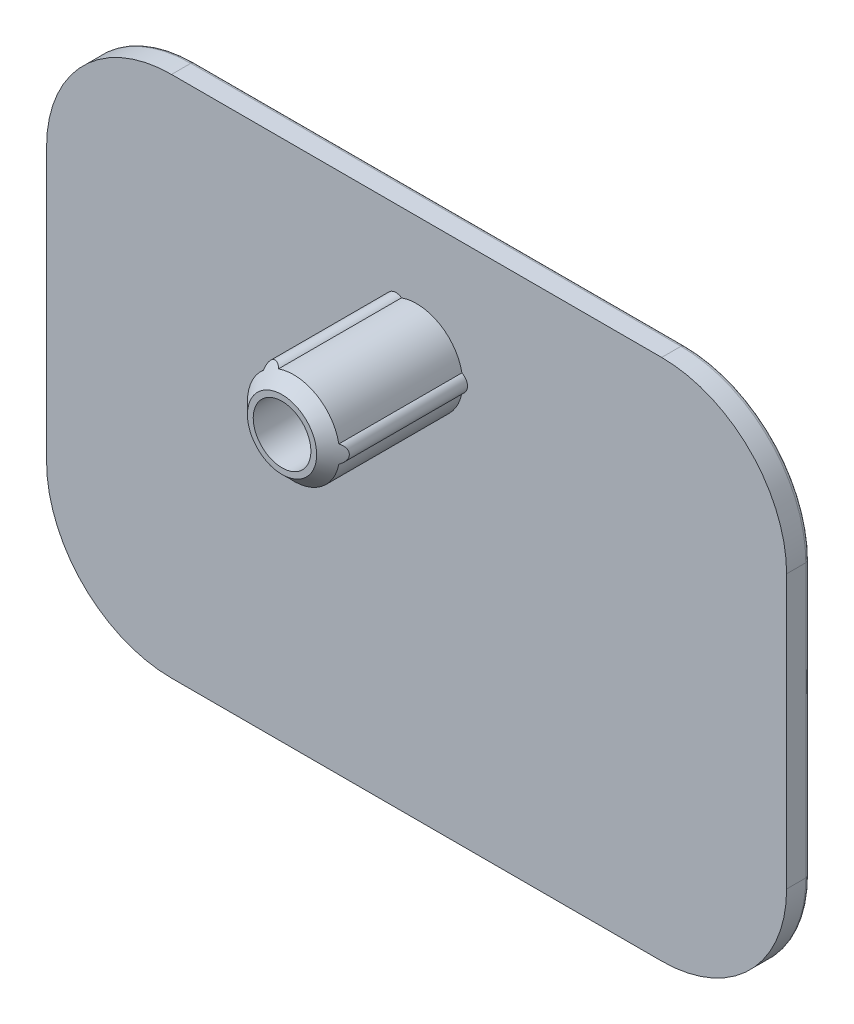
ISO-10303-21;
HEADER;
FILE_DESCRIPTION(('STEP AP214'),'2;1');
FILE_NAME('part.step','',(''),(''),'','','');
FILE_SCHEMA(('AUTOMOTIVE_DESIGN { 1 0 10303 214 1 1 1 1 }'));
ENDSEC;
DATA;
#1=APPLICATION_CONTEXT('core data for automotive mechanical design processes');
#2=APPLICATION_PROTOCOL_DEFINITION('international standard','automotive_design',2000,#1);
#3=PRODUCT_CONTEXT('',#1,'mechanical');
#4=PRODUCT('Part','Part','',(#3));
#5=PRODUCT_RELATED_PRODUCT_CATEGORY('part','',(#4));
#6=PRODUCT_DEFINITION_FORMATION('','',#4);
#7=PRODUCT_DEFINITION_CONTEXT('part definition',#1,'design');
#8=PRODUCT_DEFINITION('design','',#6,#7);
#9=PRODUCT_DEFINITION_SHAPE('','',#8);
#10=(LENGTH_UNIT() NAMED_UNIT(*) SI_UNIT(.MILLI.,.METRE.));
#11=(NAMED_UNIT(*) PLANE_ANGLE_UNIT() SI_UNIT($,.RADIAN.));
#12=(NAMED_UNIT(*) SI_UNIT($,.STERADIAN.) SOLID_ANGLE_UNIT());
#13=UNCERTAINTY_MEASURE_WITH_UNIT(LENGTH_MEASURE(1.E-05),#10,'distance_accuracy_value','');
#14=(GEOMETRIC_REPRESENTATION_CONTEXT(3) GLOBAL_UNCERTAINTY_ASSIGNED_CONTEXT((#13)) GLOBAL_UNIT_ASSIGNED_CONTEXT((#10,
#11,#12)) REPRESENTATION_CONTEXT('',''));
#15=CARTESIAN_POINT('',(0.,0.,0.));
#16=DIRECTION('',(0.,0.,1.));
#17=DIRECTION('',(1.,0.,0.));
#18=AXIS2_PLACEMENT_3D('',#15,#16,#17);
#19=CARTESIAN_POINT('',(0.,7.25,1.1));
#20=DIRECTION('',(0.,0.,-1.));
#21=DIRECTION('',(-1.,0.,0.));
#22=AXIS2_PLACEMENT_3D('',#19,#20,#21);
#23=PLANE('',#22);
#24=CARTESIAN_POINT('',(0.,7.25,1.1));
#25=DIRECTION('',(0.,0.,-1.));
#26=DIRECTION('',(-1.,0.,0.));
#27=AXIS2_PLACEMENT_3D('',#24,#25,#26);
#28=CIRCLE('',#27,1.5);
#29=CARTESIAN_POINT('',(-1.5,7.25,1.1));
#30=VERTEX_POINT('',#29);
#31=EDGE_CURVE('E19',#30,#30,#28,.F.);
#32=ORIENTED_EDGE('',*,*,#31,.T.);
#33=EDGE_LOOP('',(#32));
#34=FACE_BOUND('',#33,.T.);
#35=ADVANCED_FACE('F16',(#34),#23,.F.);
#36=CARTESIAN_POINT('',(0.,7.25,7.6));
#37=DIRECTION('',(0.,0.,-1.));
#38=DIRECTION('',(-1.,0.,0.));
#39=AXIS2_PLACEMENT_3D('',#36,#37,#38);
#40=CYLINDRICAL_SURFACE('',#39,1.5);
#41=CARTESIAN_POINT('',(0.,7.25,7.6));
#42=DIRECTION('',(0.,0.,-1.));
#43=DIRECTION('',(-1.,0.,0.));
#44=AXIS2_PLACEMENT_3D('',#41,#42,#43);
#45=CIRCLE('',#44,1.5);
#46=CARTESIAN_POINT('',(-1.5,7.25,7.6));
#47=VERTEX_POINT('',#46);
#48=EDGE_CURVE('E248',#47,#47,#45,.T.);
#49=ORIENTED_EDGE('',*,*,#48,.F.);
#50=EDGE_LOOP('',(#49));
#51=FACE_BOUND('',#50,.T.);
#52=ORIENTED_EDGE('',*,*,#31,.F.);
#53=EDGE_LOOP('',(#52));
#54=FACE_BOUND('',#53,.T.);
#55=ADVANCED_FACE('F379',(#51,#54),#40,.F.);
#56=CARTESIAN_POINT('',(0.,0.,-0.6));
#57=DIRECTION('',(0.,0.,1.));
#58=DIRECTION('',(1.,0.,0.));
#59=AXIS2_PLACEMENT_3D('',#56,#57,#58);
#60=PLANE('',#59);
#61=DIRECTION('',(0.,-1.,0.));
#62=VECTOR('',#61,1.);
#63=CARTESIAN_POINT('',(-19.05,-3.55,-0.6));
#64=LINE('',#63,#62);
#65=CARTESIAN_POINT('',(-19.05,7.1,-0.6));
#66=VERTEX_POINT('',#65);
#67=CARTESIAN_POINT('',(-19.05,-7.1,-0.6));
#68=VERTEX_POINT('',#67);
#69=EDGE_CURVE('E317',#66,#68,#64,.T.);
#70=ORIENTED_EDGE('',*,*,#69,.F.);
#71=CARTESIAN_POINT('',(-12.75,7.1,-0.6));
#72=DIRECTION('',(0.,0.,1.));
#73=DIRECTION('',(0.,1.,0.));
#74=AXIS2_PLACEMENT_3D('',#71,#72,#73);
#75=CIRCLE('',#74,6.30000000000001);
#76=CARTESIAN_POINT('',(-12.75,13.4,-0.6));
#77=VERTEX_POINT('',#76);
#78=EDGE_CURVE('E335',#77,#66,#75,.T.);
#79=ORIENTED_EDGE('',*,*,#78,.F.);
#80=DIRECTION('',(-1.,0.,0.));
#81=VECTOR('',#80,1.);
#82=CARTESIAN_POINT('',(-6.375,13.4,-0.6));
#83=LINE('',#82,#81);
#84=CARTESIAN_POINT('',(12.75,13.4,-0.6));
#85=VERTEX_POINT('',#84);
#86=EDGE_CURVE('E244',#85,#77,#83,.T.);
#87=ORIENTED_EDGE('',*,*,#86,.F.);
#88=CARTESIAN_POINT('',(12.75,7.1,-0.6));
#89=DIRECTION('',(0.,0.,1.));
#90=DIRECTION('',(1.,0.,0.));
#91=AXIS2_PLACEMENT_3D('',#88,#89,#90);
#92=CIRCLE('',#91,6.3);
#93=CARTESIAN_POINT('',(19.05,7.1,-0.6));
#94=VERTEX_POINT('',#93);
#95=EDGE_CURVE('E435',#94,#85,#92,.T.);
#96=ORIENTED_EDGE('',*,*,#95,.F.);
#97=DIRECTION('',(0.,1.,0.));
#98=VECTOR('',#97,1.);
#99=CARTESIAN_POINT('',(19.05,3.55,-0.6));
#100=LINE('',#99,#98);
#101=CARTESIAN_POINT('',(19.05,-7.1,-0.6));
#102=VERTEX_POINT('',#101);
#103=EDGE_CURVE('E232',#102,#94,#100,.T.);
#104=ORIENTED_EDGE('',*,*,#103,.F.);
#105=CARTESIAN_POINT('',(12.75,-7.1,-0.6));
#106=DIRECTION('',(0.,0.,1.));
#107=DIRECTION('',(0.,-1.,0.));
#108=AXIS2_PLACEMENT_3D('',#105,#106,#107);
#109=CIRCLE('',#108,6.30000000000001);
#110=CARTESIAN_POINT('',(12.75,-13.4,-0.6));
#111=VERTEX_POINT('',#110);
#112=EDGE_CURVE('E258',#111,#102,#109,.T.);
#113=ORIENTED_EDGE('',*,*,#112,.F.);
#114=DIRECTION('',(1.,0.,0.));
#115=VECTOR('',#114,1.);
#116=CARTESIAN_POINT('',(6.375,-13.4,-0.6));
#117=LINE('',#116,#115);
#118=CARTESIAN_POINT('',(-12.75,-13.4,-0.6));
#119=VERTEX_POINT('',#118);
#120=EDGE_CURVE('E263',#119,#111,#117,.T.);
#121=ORIENTED_EDGE('',*,*,#120,.F.);
#122=CARTESIAN_POINT('',(-12.75,-7.1,-0.6));
#123=DIRECTION('',(0.,0.,1.));
#124=DIRECTION('',(-1.,0.,0.));
#125=AXIS2_PLACEMENT_3D('',#122,#123,#124);
#126=CIRCLE('',#125,6.3);
#127=EDGE_CURVE('E293',#68,#119,#126,.T.);
#128=ORIENTED_EDGE('',*,*,#127,.F.);
#129=EDGE_LOOP('',(#70,#79,#87,#96,#104,#113,#121,#128));
#130=FACE_BOUND('',#129,.T.);
#131=ADVANCED_FACE('F370',(#130),#60,.F.);
#132=CARTESIAN_POINT('',(0.,7.25,7.6));
#133=DIRECTION('',(0.,0.,1.));
#134=DIRECTION('',(1.,0.,0.));
#135=AXIS2_PLACEMENT_3D('',#132,#133,#134);
#136=PLANE('',#135);
#137=ORIENTED_EDGE('',*,*,#48,.T.);
#138=EDGE_LOOP('',(#137));
#139=FACE_BOUND('',#138,.T.);
#140=CARTESIAN_POINT('',(0.,7.25,7.60000000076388));
#141=DIRECTION('',(0.,0.,-1.));
#142=DIRECTION('',(-1.,0.,0.));
#143=AXIS2_PLACEMENT_3D('',#140,#141,#142);
#144=CIRCLE('',#143,1.80000000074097);
#145=CARTESIAN_POINT('',(-1.80000000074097,7.25,7.60000000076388));
#146=VERTEX_POINT('',#145);
#147=EDGE_CURVE('E514',#146,#146,#144,.T.);
#148=ORIENTED_EDGE('',*,*,#147,.F.);
#149=EDGE_LOOP('',(#148));
#150=FACE_BOUND('',#149,.T.);
#151=ADVANCED_FACE('F378',(#139,#150),#136,.T.);
#152=CARTESIAN_POINT('',(-6.375,13.4,-0.4));
#153=DIRECTION('',(-1.,0.,0.));
#154=DIRECTION('',(0.,0.,1.));
#155=AXIS2_PLACEMENT_3D('',#152,#153,#154);
#156=CYLINDRICAL_SURFACE('',#155,0.2);
#157=CARTESIAN_POINT('',(-12.75,13.4,-0.4));
#158=DIRECTION('',(-1.,0.,0.));
#159=DIRECTION('',(0.,1.,0.));
#160=AXIS2_PLACEMENT_3D('',#157,#158,#159);
#161=CIRCLE('',#160,0.2);
#162=CARTESIAN_POINT('',(-12.75,13.6,-0.4));
#163=VERTEX_POINT('',#162);
#164=EDGE_CURVE('E247',#163,#77,#161,.T.);
#165=ORIENTED_EDGE('',*,*,#164,.F.);
#166=DIRECTION('',(1.,0.,0.));
#167=VECTOR('',#166,1.);
#168=CARTESIAN_POINT('',(-12.75,13.6,-0.4));
#169=LINE('',#168,#167);
#170=CARTESIAN_POINT('',(12.75,13.6,-0.4));
#171=VERTEX_POINT('',#170);
#172=EDGE_CURVE('E204',#171,#163,#169,.F.);
#173=ORIENTED_EDGE('',*,*,#172,.F.);
#174=CARTESIAN_POINT('',(12.75,13.4,-0.4));
#175=DIRECTION('',(-1.,0.,0.));
#176=DIRECTION('',(0.,1.,0.));
#177=AXIS2_PLACEMENT_3D('',#174,#175,#176);
#178=CIRCLE('',#177,0.2);
#179=EDGE_CURVE('E240',#85,#171,#178,.F.);
#180=ORIENTED_EDGE('',*,*,#179,.F.);
#181=ORIENTED_EDGE('',*,*,#86,.T.);
#182=EDGE_LOOP('',(#165,#173,#180,#181));
#183=FACE_BOUND('',#182,.T.);
#184=ADVANCED_FACE('F350',(#183),#156,.T.);
#185=CARTESIAN_POINT('',(-12.75,7.1,-0.4));
#186=DIRECTION('',(0.,0.,1.));
#187=DIRECTION('',(1.,0.,0.));
#188=AXIS2_PLACEMENT_3D('',#185,#186,#187);
#189=TOROIDAL_SURFACE('',#188,6.30000000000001,0.2);
#190=CARTESIAN_POINT('',(-19.05,7.1,-0.4));
#191=DIRECTION('',(0.,-1.,0.));
#192=DIRECTION('',(0.,0.,-1.));
#193=AXIS2_PLACEMENT_3D('',#190,#191,#192);
#194=CIRCLE('',#193,0.2);
#195=CARTESIAN_POINT('',(-19.25,7.1,-0.4));
#196=VERTEX_POINT('',#195);
#197=EDGE_CURVE('E325',#196,#66,#194,.T.);
#198=ORIENTED_EDGE('',*,*,#197,.F.);
#199=CARTESIAN_POINT('',(-12.75,7.1,-0.4));
#200=DIRECTION('',(0.,0.,1.));
#201=DIRECTION('',(1.,0.,0.));
#202=AXIS2_PLACEMENT_3D('',#199,#200,#201);
#203=CIRCLE('',#202,6.50000000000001);
#204=EDGE_CURVE('E191',#163,#196,#203,.T.);
#205=ORIENTED_EDGE('',*,*,#204,.F.);
#206=ORIENTED_EDGE('',*,*,#164,.T.);
#207=ORIENTED_EDGE('',*,*,#78,.T.);
#208=EDGE_LOOP('',(#198,#205,#206,#207));
#209=FACE_BOUND('',#208,.T.);
#210=ADVANCED_FACE('F340',(#209),#189,.T.);
#211=CARTESIAN_POINT('',(-19.05,-3.55,-0.4));
#212=DIRECTION('',(0.,-1.,0.));
#213=DIRECTION('',(0.,0.,-1.));
#214=AXIS2_PLACEMENT_3D('',#211,#212,#213);
#215=CYLINDRICAL_SURFACE('',#214,0.2);
#216=CARTESIAN_POINT('',(-19.05,-7.1,-0.4));
#217=DIRECTION('',(0.,-1.,0.));
#218=DIRECTION('',(-1.,0.,0.));
#219=AXIS2_PLACEMENT_3D('',#216,#217,#218);
#220=CIRCLE('',#219,0.2);
#221=CARTESIAN_POINT('',(-19.25,-7.1,-0.4));
#222=VERTEX_POINT('',#221);
#223=EDGE_CURVE('E302',#222,#68,#220,.T.);
#224=ORIENTED_EDGE('',*,*,#223,.F.);
#225=DIRECTION('',(0.,1.,0.));
#226=VECTOR('',#225,1.);
#227=CARTESIAN_POINT('',(-19.25,-7.1,-0.4));
#228=LINE('',#227,#226);
#229=EDGE_CURVE('E185',#196,#222,#228,.F.);
#230=ORIENTED_EDGE('',*,*,#229,.F.);
#231=ORIENTED_EDGE('',*,*,#197,.T.);
#232=ORIENTED_EDGE('',*,*,#69,.T.);
#233=EDGE_LOOP('',(#224,#230,#231,#232));
#234=FACE_BOUND('',#233,.T.);
#235=ADVANCED_FACE('F308',(#234),#215,.T.);
#236=CARTESIAN_POINT('',(-12.75,-7.1,-0.4));
#237=DIRECTION('',(0.,0.,1.));
#238=DIRECTION('',(1.,0.,0.));
#239=AXIS2_PLACEMENT_3D('',#236,#237,#238);
#240=TOROIDAL_SURFACE('',#239,6.3,0.2);
#241=CARTESIAN_POINT('',(-12.75,-13.4,-0.4));
#242=DIRECTION('',(1.,0.,0.));
#243=DIRECTION('',(0.,1.,0.));
#244=AXIS2_PLACEMENT_3D('',#241,#242,#243);
#245=CIRCLE('',#244,0.2);
#246=CARTESIAN_POINT('',(-12.75,-13.6,-0.4));
#247=VERTEX_POINT('',#246);
#248=EDGE_CURVE('E290',#247,#119,#245,.T.);
#249=ORIENTED_EDGE('',*,*,#248,.F.);
#250=CARTESIAN_POINT('',(-12.75,-7.1,-0.4));
#251=DIRECTION('',(0.,0.,1.));
#252=DIRECTION('',(1.,0.,0.));
#253=AXIS2_PLACEMENT_3D('',#250,#251,#252);
#254=CIRCLE('',#253,6.5);
#255=EDGE_CURVE('E179',#222,#247,#254,.T.);
#256=ORIENTED_EDGE('',*,*,#255,.F.);
#257=ORIENTED_EDGE('',*,*,#223,.T.);
#258=ORIENTED_EDGE('',*,*,#127,.T.);
#259=EDGE_LOOP('',(#249,#256,#257,#258));
#260=FACE_BOUND('',#259,.T.);
#261=ADVANCED_FACE('F304',(#260),#240,.T.);
#262=CARTESIAN_POINT('',(6.375,-13.4,-0.4));
#263=DIRECTION('',(1.,0.,0.));
#264=DIRECTION('',(0.,1.,0.));
#265=AXIS2_PLACEMENT_3D('',#262,#263,#264);
#266=CYLINDRICAL_SURFACE('',#265,0.2);
#267=ORIENTED_EDGE('',*,*,#248,.T.);
#268=ORIENTED_EDGE('',*,*,#120,.T.);
#269=CARTESIAN_POINT('',(12.75,-13.4,-0.4));
#270=DIRECTION('',(1.,0.,0.));
#271=DIRECTION('',(0.,-1.,0.));
#272=AXIS2_PLACEMENT_3D('',#269,#270,#271);
#273=CIRCLE('',#272,0.2);
#274=CARTESIAN_POINT('',(12.75,-13.6,-0.4));
#275=VERTEX_POINT('',#274);
#276=EDGE_CURVE('E282',#275,#111,#273,.T.);
#277=ORIENTED_EDGE('',*,*,#276,.F.);
#278=DIRECTION('',(1.,0.,0.));
#279=VECTOR('',#278,1.);
#280=CARTESIAN_POINT('',(12.75,-13.6,-0.4));
#281=LINE('',#280,#279);
#282=EDGE_CURVE('E173',#247,#275,#281,.T.);
#283=ORIENTED_EDGE('',*,*,#282,.F.);
#284=EDGE_LOOP('',(#267,#268,#277,#283));
#285=FACE_BOUND('',#284,.T.);
#286=ADVANCED_FACE('F275',(#285),#266,.T.);
#287=CARTESIAN_POINT('',(12.75,-7.1,-0.4));
#288=DIRECTION('',(0.,0.,1.));
#289=DIRECTION('',(1.,0.,0.));
#290=AXIS2_PLACEMENT_3D('',#287,#288,#289);
#291=TOROIDAL_SURFACE('',#290,6.30000000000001,0.2);
#292=ORIENTED_EDGE('',*,*,#276,.T.);
#293=ORIENTED_EDGE('',*,*,#112,.T.);
#294=CARTESIAN_POINT('',(19.05,-7.1,-0.4));
#295=DIRECTION('',(0.,1.,0.));
#296=DIRECTION('',(0.,0.,1.));
#297=AXIS2_PLACEMENT_3D('',#294,#295,#296);
#298=CIRCLE('',#297,0.2);
#299=CARTESIAN_POINT('',(19.25,-7.1,-0.4));
#300=VERTEX_POINT('',#299);
#301=EDGE_CURVE('E241',#300,#102,#298,.T.);
#302=ORIENTED_EDGE('',*,*,#301,.F.);
#303=CARTESIAN_POINT('',(12.75,-7.1,-0.4));
#304=DIRECTION('',(0.,0.,1.));
#305=DIRECTION('',(1.,0.,0.));
#306=AXIS2_PLACEMENT_3D('',#303,#304,#305);
#307=CIRCLE('',#306,6.50000000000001);
#308=EDGE_CURVE('E167',#275,#300,#307,.T.);
#309=ORIENTED_EDGE('',*,*,#308,.F.);
#310=EDGE_LOOP('',(#292,#293,#302,#309));
#311=FACE_BOUND('',#310,.T.);
#312=ADVANCED_FACE('F265',(#311),#291,.T.);
#313=CARTESIAN_POINT('',(19.05,3.55,-0.4));
#314=DIRECTION('',(0.,1.,0.));
#315=DIRECTION('',(0.,0.,1.));
#316=AXIS2_PLACEMENT_3D('',#313,#314,#315);
#317=CYLINDRICAL_SURFACE('',#316,0.2);
#318=ORIENTED_EDGE('',*,*,#301,.T.);
#319=ORIENTED_EDGE('',*,*,#103,.T.);
#320=CARTESIAN_POINT('',(19.05,7.1,-0.4));
#321=DIRECTION('',(0.,1.,0.));
#322=DIRECTION('',(1.,0.,0.));
#323=AXIS2_PLACEMENT_3D('',#320,#321,#322);
#324=CIRCLE('',#323,0.2);
#325=CARTESIAN_POINT('',(19.25,7.1,-0.4));
#326=VERTEX_POINT('',#325);
#327=EDGE_CURVE('E211',#326,#94,#324,.T.);
#328=ORIENTED_EDGE('',*,*,#327,.F.);
#329=DIRECTION('',(0.,1.,0.));
#330=VECTOR('',#329,1.);
#331=CARTESIAN_POINT('',(19.25,7.1,-0.4));
#332=LINE('',#331,#330);
#333=EDGE_CURVE('E161',#300,#326,#332,.T.);
#334=ORIENTED_EDGE('',*,*,#333,.F.);
#335=EDGE_LOOP('',(#318,#319,#328,#334));
#336=FACE_BOUND('',#335,.T.);
#337=ADVANCED_FACE('F220',(#336),#317,.T.);
#338=CARTESIAN_POINT('',(12.75,7.1,-0.4));
#339=DIRECTION('',(0.,0.,1.));
#340=DIRECTION('',(1.,0.,0.));
#341=AXIS2_PLACEMENT_3D('',#338,#339,#340);
#342=TOROIDAL_SURFACE('',#341,6.30000000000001,0.2);
#343=ORIENTED_EDGE('',*,*,#327,.T.);
#344=ORIENTED_EDGE('',*,*,#95,.T.);
#345=ORIENTED_EDGE('',*,*,#179,.T.);
#346=CARTESIAN_POINT('',(12.75,7.1,-0.4));
#347=DIRECTION('',(0.,0.,1.));
#348=DIRECTION('',(1.,0.,0.));
#349=AXIS2_PLACEMENT_3D('',#346,#347,#348);
#350=CIRCLE('',#349,6.50000000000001);
#351=EDGE_CURVE('E152',#326,#171,#350,.T.);
#352=ORIENTED_EDGE('',*,*,#351,.F.);
#353=EDGE_LOOP('',(#343,#344,#345,#352));
#354=FACE_BOUND('',#353,.T.);
#355=ADVANCED_FACE('F214',(#354),#342,.T.);
#356=CARTESIAN_POINT('',(-1.075,9.11195461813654,0.6));
#357=DIRECTION('',(0.,0.,1.));
#358=DIRECTION('',(1.,0.,0.));
#359=AXIS2_PLACEMENT_3D('',#356,#357,#358);
#360=CYLINDRICAL_SURFACE('',#359,0.5);
#361=CARTESIAN_POINT('',(-1.075,9.11195461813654,0.6));
#362=DIRECTION('',(0.,0.,1.));
#363=DIRECTION('',(1.,0.,0.));
#364=AXIS2_PLACEMENT_3D('',#361,#362,#363);
#365=CIRCLE('',#364,0.5);
#366=CARTESIAN_POINT('',(-0.783798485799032,9.5184047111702,0.6));
#367=VERTEX_POINT('',#366);
#368=CARTESIAN_POINT('',(-1.57259686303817,9.06299175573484,0.6));
#369=VERTEX_POINT('',#368);
#370=EDGE_CURVE('E64',#367,#369,#365,.T.);
#371=ORIENTED_EDGE('',*,*,#370,.T.);
#372=DIRECTION('',(0.,0.,1.));
#373=VECTOR('',#372,1.);
#374=CARTESIAN_POINT('',(-1.57259686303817,9.06299175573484,0.6));
#375=LINE('',#374,#373);
#376=CARTESIAN_POINT('',(-1.57259686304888,9.06299175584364,7.00000000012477));
#377=VERTEX_POINT('',#376);
#378=EDGE_CURVE('E143',#377,#369,#375,.F.);
#379=ORIENTED_EDGE('',*,*,#378,.F.);
#380=CARTESIAN_POINT('',(-0.783798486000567,9.51840471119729,7.00000000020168));
#381=CARTESIAN_POINT('',(-0.810386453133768,9.53747811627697,6.97326995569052));
#382=CARTESIAN_POINT('',(-0.839755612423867,9.55452835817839,6.9473577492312));
#383=CARTESIAN_POINT('',(-0.903591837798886,9.58296381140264,6.89829129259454));
#384=CARTESIAN_POINT('',(-0.938102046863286,9.59429712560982,6.87516370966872));
#385=CARTESIAN_POINT('',(-0.997817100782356,9.60652488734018,6.84100170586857));
#386=CARTESIAN_POINT('',(-1.02178258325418,9.60972475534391,6.82864604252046));
#387=CARTESIAN_POINT('',(-1.07088241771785,9.61253948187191,6.80617958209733));
#388=CARTESIAN_POINT('',(-1.09601279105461,9.61216576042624,6.79606173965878));
#389=CARTESIAN_POINT('',(-1.14711032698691,9.60739810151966,6.77843499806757));
#390=CARTESIAN_POINT('',(-1.17308328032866,9.60296475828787,6.770952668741));
#391=CARTESIAN_POINT('',(-1.22467991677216,9.58976510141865,6.75922931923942));
#392=CARTESIAN_POINT('',(-1.25030373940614,9.58100057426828,6.75498696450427));
#393=CARTESIAN_POINT('',(-1.29661905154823,9.5607681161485,6.75041023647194));
#394=CARTESIAN_POINT('',(-1.31750297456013,9.54984076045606,6.74961703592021));
#395=CARTESIAN_POINT('',(-1.35746399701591,9.52519107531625,6.75072593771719));
#396=CARTESIAN_POINT('',(-1.37654186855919,9.51146994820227,6.7526268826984));
#397=CARTESIAN_POINT('',(-1.41115113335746,9.48273134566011,6.75879340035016));
#398=CARTESIAN_POINT('',(-1.42683327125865,9.46785853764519,6.76289518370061));
#399=CARTESIAN_POINT('',(-1.45585234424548,9.43661795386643,6.7731434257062));
#400=CARTESIAN_POINT('',(-1.46918907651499,9.42025004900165,6.7792900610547));
#401=CARTESIAN_POINT('',(-1.49426394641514,9.38529173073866,6.79388089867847));
#402=CARTESIAN_POINT('',(-1.50581861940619,9.36662611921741,6.80245835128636));
#403=CARTESIAN_POINT('',(-1.52611529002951,9.3286561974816,6.82134449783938));
#404=CARTESIAN_POINT('',(-1.53485502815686,9.3093513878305,6.83165457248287));
#405=CARTESIAN_POINT('',(-1.55297453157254,9.26177935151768,6.85867480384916));
#406=CARTESIAN_POINT('',(-1.56086921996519,9.23339209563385,6.87617589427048));
#407=CARTESIAN_POINT('',(-1.57156234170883,9.17714038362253,6.91339580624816));
#408=CARTESIAN_POINT('',(-1.57435438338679,9.14927662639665,6.93311737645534));
#409=CARTESIAN_POINT('',(-1.57529897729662,9.10197460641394,6.96870196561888));
#410=CARTESIAN_POINT('',(-1.57449063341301,9.08227189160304,6.98419055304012));
#411=CARTESIAN_POINT('',(-1.572596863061,9.06299175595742,7.00000000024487));
#412=B_SPLINE_CURVE_WITH_KNOTS('',3,(#380,#381,#382,#383,#384,#385,#386,#387,#388,#389,#390,
#391,#392,#393,#394,#395,#396,#397,#398,#399,#400,#401,#402,#403,#404,#405,#406,#407,#408,#409,
#410,#411),.UNSPECIFIED.,.F.,.F.,(4,2,2,2,2,2,2,2,2,2,2,2,2,2,2,4),(0.,0.127138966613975,
0.255412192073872,0.336558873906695,0.417446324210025,0.499127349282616,0.580774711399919,
0.651145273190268,0.721485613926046,0.787198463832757,0.852916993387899,0.923352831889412,
0.993845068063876,1.09609091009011,1.19846473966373,1.27352419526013),.UNSPECIFIED.);
#413=CARTESIAN_POINT('',(-0.783798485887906,9.51840471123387,7.00000000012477));
#414=VERTEX_POINT('',#413);
#415=EDGE_CURVE('E509',#414,#377,#412,.T.);
#416=ORIENTED_EDGE('',*,*,#415,.F.);
#417=DIRECTION('',(0.,0.,1.));
#418=VECTOR('',#417,1.);
#419=CARTESIAN_POINT('',(-0.783798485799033,9.5184047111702,0.6));
#420=LINE('',#419,#418);
#421=EDGE_CURVE('E119',#367,#414,#420,.T.);
#422=ORIENTED_EDGE('',*,*,#421,.F.);
#423=EDGE_LOOP('',(#371,#379,#416,#422));
#424=FACE_BOUND('',#423,.T.);
#425=ADVANCED_FACE('F219',(#424),#360,.T.);
#426=CARTESIAN_POINT('',(0.,7.25,6.74489402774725));
#427=DIRECTION('',(0.,0.,-1.));
#428=DIRECTION('',(-1.,0.,0.));
#429=AXIS2_PLACEMENT_3D('',#426,#427,#428);
#430=CONICAL_SURFACE('',#429,2.65510597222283,0.785398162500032);
#431=ORIENTED_EDGE('',*,*,#147,.T.);
#432=EDGE_LOOP('',(#431));
#433=FACE_BOUND('',#432,.T.);
#434=CARTESIAN_POINT('',(0.,7.25,7.));
#435=DIRECTION('',(0.,0.,1.));
#436=DIRECTION('',(1.,0.,0.));
#437=AXIS2_PLACEMENT_3D('',#434,#435,#436);
#438=CIRCLE('',#437,2.4);
#439=CARTESIAN_POINT('',(2.35639534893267,7.70541295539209,7.00000000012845));
#440=VERTEX_POINT('',#439);
#441=EDGE_CURVE('E140',#414,#440,#438,.F.);
#442=ORIENTED_EDGE('',*,*,#441,.F.);
#443=ORIENTED_EDGE('',*,*,#415,.T.);
#444=CARTESIAN_POINT('',(0.,7.25,7.));
#445=DIRECTION('',(0.,0.,1.));
#446=DIRECTION('',(1.,0.,0.));
#447=AXIS2_PLACEMENT_3D('',#444,#445,#446);
#448=CIRCLE('',#447,2.4);
#449=CARTESIAN_POINT('',(-1.57259686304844,5.43700824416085,7.00000000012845));
#450=VERTEX_POINT('',#449);
#451=EDGE_CURVE('E146',#450,#377,#448,.F.);
#452=ORIENTED_EDGE('',*,*,#451,.F.);
#453=CARTESIAN_POINT('',(-0.783798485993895,4.98159528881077,7.00000000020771));
#454=CARTESIAN_POINT('',(-0.810386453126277,4.96252188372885,6.97326995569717));
#455=CARTESIAN_POINT('',(-0.83975561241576,4.94547164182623,6.94735774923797));
#456=CARTESIAN_POINT('',(-0.903591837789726,4.91703618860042,6.89829129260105));
#457=CARTESIAN_POINT('',(-0.938102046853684,4.90570287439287,6.87516370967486));
#458=CARTESIAN_POINT('',(-0.997817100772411,4.89347511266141,6.84100170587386));
#459=CARTESIAN_POINT('',(-1.02178258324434,4.89027524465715,6.82864604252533));
#460=CARTESIAN_POINT('',(-1.07088241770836,4.88746051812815,6.80617958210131));
#461=CARTESIAN_POINT('',(-1.09601279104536,4.88783423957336,6.79606173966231));
#462=CARTESIAN_POINT('',(-1.14711032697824,4.89260189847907,6.77843499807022));
#463=CARTESIAN_POINT('',(-1.17308328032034,4.89703524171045,6.77095266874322));
#464=CARTESIAN_POINT('',(-1.22467991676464,4.91023489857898,6.75922931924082));
#465=CARTESIAN_POINT('',(-1.25030373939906,4.91899942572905,6.75498696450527));
#466=CARTESIAN_POINT('',(-1.2966190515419,4.93923188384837,6.75041023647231));
#467=CARTESIAN_POINT('',(-1.31750297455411,4.95015923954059,6.74961703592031));
#468=CARTESIAN_POINT('',(-1.35746399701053,4.97480892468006,6.75072593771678));
#469=CARTESIAN_POINT('',(-1.37654186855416,4.98853005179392,6.75262688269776));
#470=CARTESIAN_POINT('',(-1.41115113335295,5.0172686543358,6.75879340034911));
#471=CARTESIAN_POINT('',(-1.42683327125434,5.03214146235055,6.76289518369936));
#472=CARTESIAN_POINT('',(-1.4558523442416,5.06338204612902,6.77314342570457));
#473=CARTESIAN_POINT('',(-1.46918907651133,5.07974995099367,6.77929006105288));
#474=CARTESIAN_POINT('',(-1.49426394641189,5.11470826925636,6.79388089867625));
#475=CARTESIAN_POINT('',(-1.50581861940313,5.13337388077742,6.80245835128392));
#476=CARTESIAN_POINT('',(-1.52611529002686,5.1713438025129,6.82134449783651));
#477=CARTESIAN_POINT('',(-1.53485502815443,5.19064861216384,6.8316545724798));
#478=CARTESIAN_POINT('',(-1.55297453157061,5.23822064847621,6.8586748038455));
#479=CARTESIAN_POINT('',(-1.56086921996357,5.26660790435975,6.87617589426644));
#480=CARTESIAN_POINT('',(-1.57156234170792,5.32285961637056,6.91339580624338));
#481=CARTESIAN_POINT('',(-1.57435438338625,5.35072337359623,6.93311737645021));
#482=CARTESIAN_POINT('',(-1.57529897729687,5.39802539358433,6.96870196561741));
#483=CARTESIAN_POINT('',(-1.574490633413,5.41772810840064,6.98419055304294));
#484=CARTESIAN_POINT('',(-1.57259686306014,5.43700824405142,7.00000000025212));
#485=B_SPLINE_CURVE_WITH_KNOTS('',3,(#453,#454,#455,#456,#457,#458,#459,#460,#461,#462,#463,
#464,#465,#466,#467,#468,#469,#470,#471,#472,#473,#474,#475,#476,#477,#478,#479,#480,#481,#482,
#483,#484),.UNSPECIFIED.,.F.,.F.,(4,2,2,2,2,2,2,2,2,2,2,2,2,2,2,4),(0.,0.127138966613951,
0.255412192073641,0.336558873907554,0.417446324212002,0.499127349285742,0.580774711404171,
0.651145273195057,0.721485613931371,0.787198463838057,0.852916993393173,0.923352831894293,
0.993845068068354,1.0960909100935,1.19846473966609,1.27352419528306),.UNSPECIFIED.);
#486=CARTESIAN_POINT('',(-0.78379848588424,4.98159528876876,7.00000000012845));
#487=VERTEX_POINT('',#486);
#488=EDGE_CURVE('E115',#487,#450,#485,.T.);
#489=ORIENTED_EDGE('',*,*,#488,.F.);
#490=CARTESIAN_POINT('',(0.,7.25,7.));
#491=DIRECTION('',(0.,0.,1.));
#492=DIRECTION('',(1.,0.,0.));
#493=AXIS2_PLACEMENT_3D('',#490,#491,#492);
#494=CIRCLE('',#493,2.4);
#495=CARTESIAN_POINT('',(2.35639534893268,6.79458704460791,7.00000000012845));
#496=VERTEX_POINT('',#495);
#497=EDGE_CURVE('E108',#496,#487,#494,.F.);
#498=ORIENTED_EDGE('',*,*,#497,.F.);
#499=CARTESIAN_POINT('',(2.35639534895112,7.70541295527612,7.00000000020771));
#500=CARTESIAN_POINT('',(2.38620738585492,7.69192380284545,6.97326995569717));
#501=CARTESIAN_POINT('',(2.41565790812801,7.67501448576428,6.94735774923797));
#502=CARTESIAN_POINT('',(2.47220184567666,7.63394841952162,6.89829129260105));
#503=CARTESIAN_POINT('',(2.49927188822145,7.6097283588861,6.87516370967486));
#504=CARTESIAN_POINT('',(2.53971896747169,7.56412748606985,6.84100170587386));
#505=CARTESIAN_POINT('',(2.5544728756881,7.54497270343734,6.82864604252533));
#506=CARTESIAN_POINT('',(2.58146041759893,7.50385836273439,6.80617958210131));
#507=CARTESIAN_POINT('',(2.59370195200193,7.48190796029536,6.79606173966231));
#508=CARTESIAN_POINT('',(2.61512180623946,7.43527236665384,6.77843499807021));
#509=CARTESIAN_POINT('',(2.62426889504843,7.41056245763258,6.77095266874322));
#510=CARTESIAN_POINT('',(2.6386359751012,7.35927863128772,6.75922931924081));
#511=CARTESIAN_POINT('',(2.64385758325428,7.33270548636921,6.75498696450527));
#512=CARTESIAN_POINT('',(2.64949341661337,7.28247902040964,6.75041023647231));
#513=CARTESIAN_POINT('',(2.65047201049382,7.25892933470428,6.7496170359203));
#514=CARTESIAN_POINT('',(2.64910526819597,7.21199723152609,6.75072593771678));
#515=CARTESIAN_POINT('',(2.64676135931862,7.18861474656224,6.75262688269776));
#516=CARTESIAN_POINT('',(2.63917763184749,7.14427294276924,6.75879340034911));
#517=CARTESIAN_POINT('',(2.6341384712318,7.12325540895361,6.76289518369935));
#518=CARTESIAN_POINT('',(2.62159286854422,7.08250386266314,6.77314342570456));
#519=CARTESIAN_POINT('',(2.61408621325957,7.06276996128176,6.77929006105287));
#520=CARTESIAN_POINT('',(2.59634885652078,7.02357532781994,6.79388089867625));
#521=CARTESIAN_POINT('',(2.58596129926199,7.00423588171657,6.80245835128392));
#522=CARTESIAN_POINT('',(2.56322671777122,6.96767348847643,6.82134449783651));
#523=CARTESIAN_POINT('',(2.55087813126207,6.95045224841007,6.83165457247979));
#524=CARTESIAN_POINT('',(2.51873929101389,6.91097427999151,6.8586748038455));
#525=CARTESIAN_POINT('',(2.4981025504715,6.88994365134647,6.87617589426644));
#526=CARTESIAN_POINT('',(2.45473369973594,6.8525572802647,6.91339580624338));
#527=CARTESIAN_POINT('',(2.4319989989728,6.83620742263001,6.9331173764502));
#528=CARTESIAN_POINT('',(2.39150654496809,6.8117383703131,6.96870196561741));
#529=CARTESIAN_POINT('',(2.37403932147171,6.80258705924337,6.98419055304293));
#530=CARTESIAN_POINT('',(2.35639534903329,6.79458704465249,7.00000000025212));
#531=B_SPLINE_CURVE_WITH_KNOTS('',3,(#499,#500,#501,#502,#503,#504,#505,#506,#507,#508,#509,
#510,#511,#512,#513,#514,#515,#516,#517,#518,#519,#520,#521,#522,#523,#524,#525,#526,#527,#528,
#529,#530),.UNSPECIFIED.,.F.,.F.,(4,2,2,2,2,2,2,2,2,2,2,2,2,2,2,4),(0.,0.127138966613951,
0.255412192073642,0.336558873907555,0.417446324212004,0.499127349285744,0.580774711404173,
0.651145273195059,0.721485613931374,0.787198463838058,0.852916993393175,0.923352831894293,
0.993845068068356,1.0960909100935,1.19846473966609,1.27352419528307),.UNSPECIFIED.);
#532=EDGE_CURVE('E112',#440,#496,#531,.T.);
#533=ORIENTED_EDGE('',*,*,#532,.F.);
#534=EDGE_LOOP('',(#442,#443,#452,#489,#498,#533));
#535=FACE_BOUND('',#534,.T.);
#536=ADVANCED_FACE('F111',(#433,#535),#430,.T.);
#537=CARTESIAN_POINT('',(-1.075,5.38804538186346,0.6));
#538=DIRECTION('',(0.,0.,1.));
#539=DIRECTION('',(1.,0.,0.));
#540=AXIS2_PLACEMENT_3D('',#537,#538,#539);
#541=CYLINDRICAL_SURFACE('',#540,0.5);
#542=CARTESIAN_POINT('',(-1.075,5.38804538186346,0.6));
#543=DIRECTION('',(0.,0.,1.));
#544=DIRECTION('',(1.,0.,0.));
#545=AXIS2_PLACEMENT_3D('',#542,#543,#544);
#546=CIRCLE('',#545,0.5);
#547=CARTESIAN_POINT('',(-1.57259686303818,5.43700824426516,0.6));
#548=VERTEX_POINT('',#547);
#549=CARTESIAN_POINT('',(-0.783798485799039,4.9815952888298,0.6));
#550=VERTEX_POINT('',#549);
#551=EDGE_CURVE('E34',#548,#550,#546,.T.);
#552=ORIENTED_EDGE('',*,*,#551,.T.);
#553=DIRECTION('',(0.,0.,1.));
#554=VECTOR('',#553,1.);
#555=CARTESIAN_POINT('',(-0.783798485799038,4.9815952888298,0.6));
#556=LINE('',#555,#554);
#557=EDGE_CURVE('E118',#487,#550,#556,.F.);
#558=ORIENTED_EDGE('',*,*,#557,.F.);
#559=ORIENTED_EDGE('',*,*,#488,.T.);
#560=DIRECTION('',(0.,0.,1.));
#561=VECTOR('',#560,1.);
#562=CARTESIAN_POINT('',(-1.57259686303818,5.43700824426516,0.6));
#563=LINE('',#562,#561);
#564=EDGE_CURVE('E145',#548,#450,#563,.T.);
#565=ORIENTED_EDGE('',*,*,#564,.F.);
#566=EDGE_LOOP('',(#552,#558,#559,#565));
#567=FACE_BOUND('',#566,.T.);
#568=ADVANCED_FACE('F499',(#567),#541,.T.);
#569=CARTESIAN_POINT('',(2.15,7.25,0.6));
#570=DIRECTION('',(0.,0.,1.));
#571=DIRECTION('',(1.,0.,0.));
#572=AXIS2_PLACEMENT_3D('',#569,#570,#571);
#573=CYLINDRICAL_SURFACE('',#572,0.5);
#574=CARTESIAN_POINT('',(2.15,7.25,0.6));
#575=DIRECTION('',(0.,0.,1.));
#576=DIRECTION('',(1.,0.,0.));
#577=AXIS2_PLACEMENT_3D('',#574,#575,#576);
#578=CIRCLE('',#577,0.5);
#579=CARTESIAN_POINT('',(2.35639534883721,6.79458704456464,0.6));
#580=VERTEX_POINT('',#579);
#581=CARTESIAN_POINT('',(2.35639534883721,7.70541295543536,0.6));
#582=VERTEX_POINT('',#581);
#583=EDGE_CURVE('E129',#580,#582,#578,.T.);
#584=ORIENTED_EDGE('',*,*,#583,.T.);
#585=DIRECTION('',(0.,0.,1.));
#586=VECTOR('',#585,1.);
#587=CARTESIAN_POINT('',(2.35639534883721,7.70541295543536,0.6));
#588=LINE('',#587,#586);
#589=EDGE_CURVE('E127',#440,#582,#588,.F.);
#590=ORIENTED_EDGE('',*,*,#589,.F.);
#591=ORIENTED_EDGE('',*,*,#532,.T.);
#592=DIRECTION('',(0.,0.,1.));
#593=VECTOR('',#592,1.);
#594=CARTESIAN_POINT('',(2.35639534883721,6.79458704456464,0.6));
#595=LINE('',#594,#593);
#596=EDGE_CURVE('E124',#580,#496,#595,.T.);
#597=ORIENTED_EDGE('',*,*,#596,.F.);
#598=EDGE_LOOP('',(#584,#590,#591,#597));
#599=FACE_BOUND('',#598,.T.);
#600=ADVANCED_FACE('F123',(#599),#573,.T.);
#601=CARTESIAN_POINT('',(-12.75,13.6,0.));
#602=DIRECTION('',(0.,1.,0.));
#603=DIRECTION('',(0.,0.,1.));
#604=AXIS2_PLACEMENT_3D('',#601,#602,#603);
#605=PLANE('',#604);
#606=DIRECTION('',(1.,0.,0.));
#607=VECTOR('',#606,1.);
#608=CARTESIAN_POINT('',(0.,13.6,0.6));
#609=LINE('',#608,#607);
#610=CARTESIAN_POINT('',(12.75,13.6,0.6));
#611=VERTEX_POINT('',#610);
#612=CARTESIAN_POINT('',(-12.75,13.6,0.6));
#613=VERTEX_POINT('',#612);
#614=EDGE_CURVE('E132',#611,#613,#609,.F.);
#615=ORIENTED_EDGE('',*,*,#614,.F.);
#616=DIRECTION('',(0.,0.,1.));
#617=VECTOR('',#616,1.);
#618=CARTESIAN_POINT('',(12.75,13.6,0.));
#619=LINE('',#618,#617);
#620=EDGE_CURVE('E149',#171,#611,#619,.T.);
#621=ORIENTED_EDGE('',*,*,#620,.F.);
#622=ORIENTED_EDGE('',*,*,#172,.T.);
#623=DIRECTION('',(0.,0.,1.));
#624=VECTOR('',#623,1.);
#625=CARTESIAN_POINT('',(-12.75,13.6,0.));
#626=LINE('',#625,#624);
#627=EDGE_CURVE('E188',#613,#163,#626,.F.);
#628=ORIENTED_EDGE('',*,*,#627,.F.);
#629=EDGE_LOOP('',(#615,#621,#622,#628));
#630=FACE_BOUND('',#629,.T.);
#631=ADVANCED_FACE('F458',(#630),#605,.T.);
#632=CARTESIAN_POINT('',(-12.75,7.1,0.));
#633=DIRECTION('',(0.,0.,1.));
#634=DIRECTION('',(1.,0.,0.));
#635=AXIS2_PLACEMENT_3D('',#632,#633,#634);
#636=CYLINDRICAL_SURFACE('',#635,6.50000000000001);
#637=CARTESIAN_POINT('',(-12.75,7.1,0.6));
#638=DIRECTION('',(0.,0.,1.));
#639=DIRECTION('',(1.,0.,0.));
#640=AXIS2_PLACEMENT_3D('',#637,#638,#639);
#641=CIRCLE('',#640,6.50000000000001);
#642=CARTESIAN_POINT('',(-19.25,7.1,0.6));
#643=VERTEX_POINT('',#642);
#644=EDGE_CURVE('E135',#613,#643,#641,.T.);
#645=ORIENTED_EDGE('',*,*,#644,.F.);
#646=ORIENTED_EDGE('',*,*,#627,.T.);
#647=ORIENTED_EDGE('',*,*,#204,.T.);
#648=DIRECTION('',(0.,0.,1.));
#649=VECTOR('',#648,1.);
#650=CARTESIAN_POINT('',(-19.25,7.1,0.));
#651=LINE('',#650,#649);
#652=EDGE_CURVE('E182',#643,#196,#651,.F.);
#653=ORIENTED_EDGE('',*,*,#652,.F.);
#654=EDGE_LOOP('',(#645,#646,#647,#653));
#655=FACE_BOUND('',#654,.T.);
#656=ADVANCED_FACE('F563',(#655),#636,.T.);
#657=CARTESIAN_POINT('',(-19.25,-7.1,0.));
#658=DIRECTION('',(-1.,0.,0.));
#659=DIRECTION('',(0.,0.,1.));
#660=AXIS2_PLACEMENT_3D('',#657,#658,#659);
#661=PLANE('',#660);
#662=DIRECTION('',(0.,1.,0.));
#663=VECTOR('',#662,1.);
#664=CARTESIAN_POINT('',(-19.25,0.,0.6));
#665=LINE('',#664,#663);
#666=CARTESIAN_POINT('',(-19.25,-7.1,0.6));
#667=VERTEX_POINT('',#666);
#668=EDGE_CURVE('E479',#643,#667,#665,.F.);
#669=ORIENTED_EDGE('',*,*,#668,.F.);
#670=ORIENTED_EDGE('',*,*,#652,.T.);
#671=ORIENTED_EDGE('',*,*,#229,.T.);
#672=DIRECTION('',(0.,0.,1.));
#673=VECTOR('',#672,1.);
#674=CARTESIAN_POINT('',(-19.25,-7.1,0.));
#675=LINE('',#674,#673);
#676=EDGE_CURVE('E176',#667,#222,#675,.F.);
#677=ORIENTED_EDGE('',*,*,#676,.F.);
#678=EDGE_LOOP('',(#669,#670,#671,#677));
#679=FACE_BOUND('',#678,.T.);
#680=ADVANCED_FACE('F559',(#679),#661,.T.);
#681=CARTESIAN_POINT('',(-12.75,-7.1,0.));
#682=DIRECTION('',(0.,0.,1.));
#683=DIRECTION('',(1.,0.,0.));
#684=AXIS2_PLACEMENT_3D('',#681,#682,#683);
#685=CYLINDRICAL_SURFACE('',#684,6.5);
#686=CARTESIAN_POINT('',(-12.75,-7.1,0.6));
#687=DIRECTION('',(0.,0.,1.));
#688=DIRECTION('',(1.,0.,0.));
#689=AXIS2_PLACEMENT_3D('',#686,#687,#688);
#690=CIRCLE('',#689,6.5);
#691=CARTESIAN_POINT('',(-12.75,-13.6,0.6));
#692=VERTEX_POINT('',#691);
#693=EDGE_CURVE('E478',#667,#692,#690,.T.);
#694=ORIENTED_EDGE('',*,*,#693,.F.);
#695=ORIENTED_EDGE('',*,*,#676,.T.);
#696=ORIENTED_EDGE('',*,*,#255,.T.);
#697=DIRECTION('',(0.,0.,-1.));
#698=VECTOR('',#697,1.);
#699=CARTESIAN_POINT('',(-12.75,-13.6,0.));
#700=LINE('',#699,#698);
#701=EDGE_CURVE('E170',#692,#247,#700,.T.);
#702=ORIENTED_EDGE('',*,*,#701,.F.);
#703=EDGE_LOOP('',(#694,#695,#696,#702));
#704=FACE_BOUND('',#703,.T.);
#705=ADVANCED_FACE('F555',(#704),#685,.T.);
#706=CARTESIAN_POINT('',(12.75,-13.6,0.));
#707=DIRECTION('',(0.,-1.,0.));
#708=DIRECTION('',(0.,0.,-1.));
#709=AXIS2_PLACEMENT_3D('',#706,#707,#708);
#710=PLANE('',#709);
#711=DIRECTION('',(1.,0.,0.));
#712=VECTOR('',#711,1.);
#713=CARTESIAN_POINT('',(0.,-13.6,0.6));
#714=LINE('',#713,#712);
#715=CARTESIAN_POINT('',(12.75,-13.6,0.6));
#716=VERTEX_POINT('',#715);
#717=EDGE_CURVE('E474',#692,#716,#714,.T.);
#718=ORIENTED_EDGE('',*,*,#717,.F.);
#719=ORIENTED_EDGE('',*,*,#701,.T.);
#720=ORIENTED_EDGE('',*,*,#282,.T.);
#721=DIRECTION('',(0.,0.,1.));
#722=VECTOR('',#721,1.);
#723=CARTESIAN_POINT('',(12.75,-13.6,0.));
#724=LINE('',#723,#722);
#725=EDGE_CURVE('E164',#716,#275,#724,.F.);
#726=ORIENTED_EDGE('',*,*,#725,.F.);
#727=EDGE_LOOP('',(#718,#719,#720,#726));
#728=FACE_BOUND('',#727,.T.);
#729=ADVANCED_FACE('F551',(#728),#710,.T.);
#730=CARTESIAN_POINT('',(12.75,-7.1,0.));
#731=DIRECTION('',(0.,0.,1.));
#732=DIRECTION('',(1.,0.,0.));
#733=AXIS2_PLACEMENT_3D('',#730,#731,#732);
#734=CYLINDRICAL_SURFACE('',#733,6.50000000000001);
#735=CARTESIAN_POINT('',(12.75,-7.1,0.6));
#736=DIRECTION('',(0.,0.,1.));
#737=DIRECTION('',(1.,0.,0.));
#738=AXIS2_PLACEMENT_3D('',#735,#736,#737);
#739=CIRCLE('',#738,6.50000000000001);
#740=CARTESIAN_POINT('',(19.25,-7.1,0.6));
#741=VERTEX_POINT('',#740);
#742=EDGE_CURVE('E472',#716,#741,#739,.T.);
#743=ORIENTED_EDGE('',*,*,#742,.F.);
#744=ORIENTED_EDGE('',*,*,#725,.T.);
#745=ORIENTED_EDGE('',*,*,#308,.T.);
#746=DIRECTION('',(0.,0.,-1.));
#747=VECTOR('',#746,1.);
#748=CARTESIAN_POINT('',(19.25,-7.1,0.));
#749=LINE('',#748,#747);
#750=EDGE_CURVE('E158',#741,#300,#749,.T.);
#751=ORIENTED_EDGE('',*,*,#750,.F.);
#752=EDGE_LOOP('',(#743,#744,#745,#751));
#753=FACE_BOUND('',#752,.T.);
#754=ADVANCED_FACE('F548',(#753),#734,.T.);
#755=CARTESIAN_POINT('',(19.25,7.1,0.));
#756=DIRECTION('',(1.,0.,0.));
#757=DIRECTION('',(0.,0.,-1.));
#758=AXIS2_PLACEMENT_3D('',#755,#756,#757);
#759=PLANE('',#758);
#760=DIRECTION('',(0.,1.,0.));
#761=VECTOR('',#760,1.);
#762=CARTESIAN_POINT('',(19.25,0.,0.6));
#763=LINE('',#762,#761);
#764=CARTESIAN_POINT('',(19.25,7.1,0.6));
#765=VERTEX_POINT('',#764);
#766=EDGE_CURVE('E466',#741,#765,#763,.T.);
#767=ORIENTED_EDGE('',*,*,#766,.F.);
#768=ORIENTED_EDGE('',*,*,#750,.T.);
#769=ORIENTED_EDGE('',*,*,#333,.T.);
#770=DIRECTION('',(0.,0.,1.));
#771=VECTOR('',#770,1.);
#772=CARTESIAN_POINT('',(19.25,7.1,0.));
#773=LINE('',#772,#771);
#774=EDGE_CURVE('E79',#765,#326,#773,.F.);
#775=ORIENTED_EDGE('',*,*,#774,.F.);
#776=EDGE_LOOP('',(#767,#768,#769,#775));
#777=FACE_BOUND('',#776,.T.);
#778=ADVANCED_FACE('F545',(#777),#759,.T.);
#779=CARTESIAN_POINT('',(12.75,7.1,0.));
#780=DIRECTION('',(0.,0.,1.));
#781=DIRECTION('',(1.,0.,0.));
#782=AXIS2_PLACEMENT_3D('',#779,#780,#781);
#783=CYLINDRICAL_SURFACE('',#782,6.50000000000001);
#784=CARTESIAN_POINT('',(12.75,7.1,0.6));
#785=DIRECTION('',(0.,0.,1.));
#786=DIRECTION('',(1.,0.,0.));
#787=AXIS2_PLACEMENT_3D('',#784,#785,#786);
#788=CIRCLE('',#787,6.50000000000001);
#789=EDGE_CURVE('E462',#765,#611,#788,.T.);
#790=ORIENTED_EDGE('',*,*,#789,.F.);
#791=ORIENTED_EDGE('',*,*,#774,.T.);
#792=ORIENTED_EDGE('',*,*,#351,.T.);
#793=ORIENTED_EDGE('',*,*,#620,.T.);
#794=EDGE_LOOP('',(#790,#791,#792,#793));
#795=FACE_BOUND('',#794,.T.);
#796=ADVANCED_FACE('F461',(#795),#783,.T.);
#797=CARTESIAN_POINT('',(0.,7.25,0.6));
#798=DIRECTION('',(0.,0.,1.));
#799=DIRECTION('',(1.,0.,0.));
#800=AXIS2_PLACEMENT_3D('',#797,#798,#799);
#801=CYLINDRICAL_SURFACE('',#800,2.4);
#802=CARTESIAN_POINT('',(0.,7.25,0.6));
#803=DIRECTION('',(0.,0.,1.));
#804=DIRECTION('',(1.,0.,0.));
#805=AXIS2_PLACEMENT_3D('',#802,#803,#804);
#806=CIRCLE('',#805,2.4);
#807=EDGE_CURVE('E465',#548,#369,#806,.F.);
#808=ORIENTED_EDGE('',*,*,#807,.F.);
#809=ORIENTED_EDGE('',*,*,#564,.T.);
#810=ORIENTED_EDGE('',*,*,#451,.T.);
#811=ORIENTED_EDGE('',*,*,#378,.T.);
#812=EDGE_LOOP('',(#808,#809,#810,#811));
#813=FACE_BOUND('',#812,.T.);
#814=ADVANCED_FACE('F538',(#813),#801,.T.);
#815=CARTESIAN_POINT('',(0.,7.25,0.6));
#816=DIRECTION('',(0.,0.,1.));
#817=DIRECTION('',(1.,0.,0.));
#818=AXIS2_PLACEMENT_3D('',#815,#816,#817);
#819=CYLINDRICAL_SURFACE('',#818,2.4);
#820=CARTESIAN_POINT('',(0.,7.25,0.6));
#821=DIRECTION('',(0.,0.,1.));
#822=DIRECTION('',(1.,0.,0.));
#823=AXIS2_PLACEMENT_3D('',#820,#821,#822);
#824=CIRCLE('',#823,2.4);
#825=EDGE_CURVE('E25',#367,#582,#824,.F.);
#826=ORIENTED_EDGE('',*,*,#825,.F.);
#827=ORIENTED_EDGE('',*,*,#421,.T.);
#828=ORIENTED_EDGE('',*,*,#441,.T.);
#829=ORIENTED_EDGE('',*,*,#589,.T.);
#830=EDGE_LOOP('',(#826,#827,#828,#829));
#831=FACE_BOUND('',#830,.T.);
#832=ADVANCED_FACE('F533',(#831),#819,.T.);
#833=CARTESIAN_POINT('',(0.,7.25,0.6));
#834=DIRECTION('',(0.,0.,1.));
#835=DIRECTION('',(1.,0.,0.));
#836=AXIS2_PLACEMENT_3D('',#833,#834,#835);
#837=CYLINDRICAL_SURFACE('',#836,2.4);
#838=CARTESIAN_POINT('',(0.,7.25,0.6));
#839=DIRECTION('',(0.,0.,1.));
#840=DIRECTION('',(1.,0.,0.));
#841=AXIS2_PLACEMENT_3D('',#838,#839,#840);
#842=CIRCLE('',#841,2.4);
#843=EDGE_CURVE('E11',#580,#550,#842,.F.);
#844=ORIENTED_EDGE('',*,*,#843,.F.);
#845=ORIENTED_EDGE('',*,*,#596,.T.);
#846=ORIENTED_EDGE('',*,*,#497,.T.);
#847=ORIENTED_EDGE('',*,*,#557,.T.);
#848=EDGE_LOOP('',(#844,#845,#846,#847));
#849=FACE_BOUND('',#848,.T.);
#850=ADVANCED_FACE('F131',(#849),#837,.T.);
#851=CARTESIAN_POINT('',(0.,0.,0.6));
#852=DIRECTION('',(0.,0.,1.));
#853=DIRECTION('',(1.,0.,0.));
#854=AXIS2_PLACEMENT_3D('',#851,#852,#853);
#855=PLANE('',#854);
#856=ORIENTED_EDGE('',*,*,#843,.T.);
#857=ORIENTED_EDGE('',*,*,#551,.F.);
#858=ORIENTED_EDGE('',*,*,#807,.T.);
#859=ORIENTED_EDGE('',*,*,#370,.F.);
#860=ORIENTED_EDGE('',*,*,#825,.T.);
#861=ORIENTED_EDGE('',*,*,#583,.F.);
#862=EDGE_LOOP('',(#856,#857,#858,#859,#860,#861));
#863=FACE_BOUND('',#862,.T.);
#864=ORIENTED_EDGE('',*,*,#766,.T.);
#865=ORIENTED_EDGE('',*,*,#789,.T.);
#866=ORIENTED_EDGE('',*,*,#614,.T.);
#867=ORIENTED_EDGE('',*,*,#644,.T.);
#868=ORIENTED_EDGE('',*,*,#668,.T.);
#869=ORIENTED_EDGE('',*,*,#693,.T.);
#870=ORIENTED_EDGE('',*,*,#717,.T.);
#871=ORIENTED_EDGE('',*,*,#742,.T.);
#872=EDGE_LOOP('',(#864,#865,#866,#867,#868,#869,#870,#871));
#873=FACE_BOUND('',#872,.T.);
#874=ADVANCED_FACE('F469',(#863,#873),#855,.T.);
#875=CLOSED_SHELL('',(#35,#55,#131,#151,#184,#210,#235,#261,#286,#312,#337,#355,#425,#536,#568,
#600,#631,#656,#680,#705,#729,#754,#778,#796,#814,#832,#850,#874));
#876=MANIFOLD_SOLID_BREP('B1',#875);
#877=ADVANCED_BREP_SHAPE_REPRESENTATION('',(#18,#876),#14);
#878=SHAPE_DEFINITION_REPRESENTATION(#9,#877);
ENDSEC;
END-ISO-10303-21;
